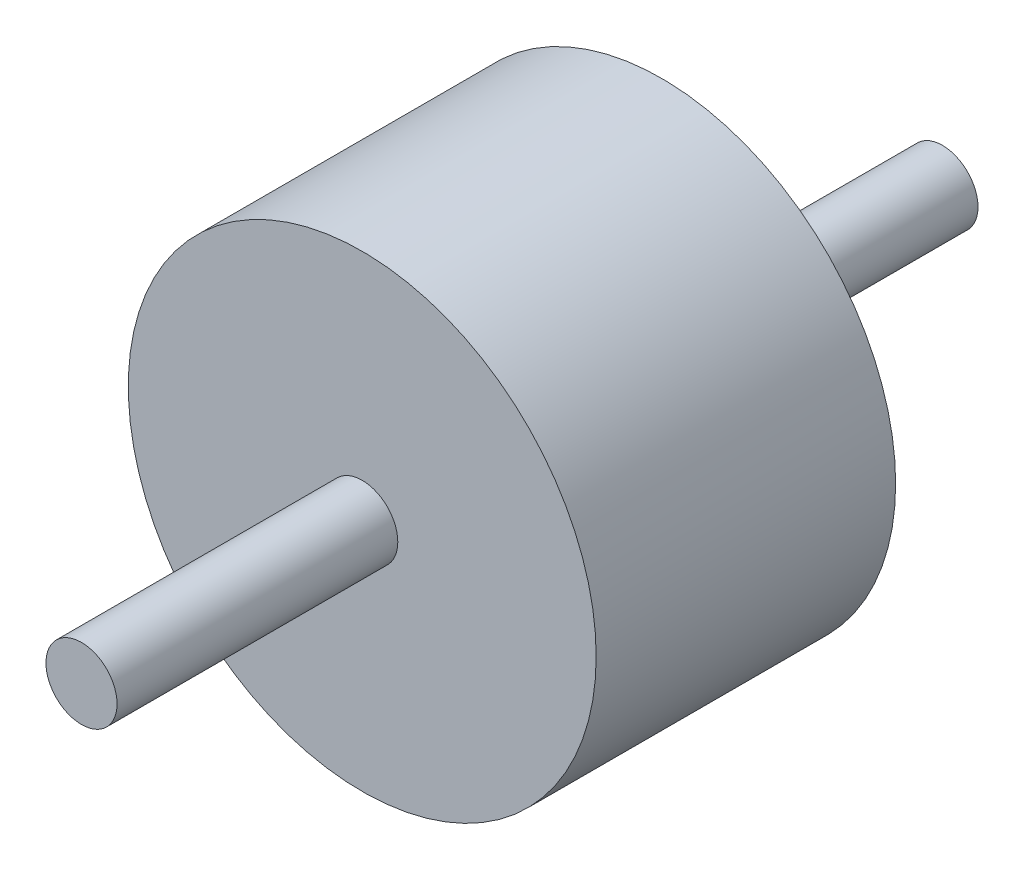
ISO-10303-21;
HEADER;
FILE_DESCRIPTION(('STEP AP214'),'2;1');
FILE_NAME('part.step','',(''),(''),'','','');
FILE_SCHEMA(('AUTOMOTIVE_DESIGN { 1 0 10303 214 1 1 1 1 }'));
ENDSEC;
DATA;
#1=APPLICATION_CONTEXT('core data for automotive mechanical design processes');
#2=APPLICATION_PROTOCOL_DEFINITION('international standard','automotive_design',2000,#1);
#3=PRODUCT_CONTEXT('',#1,'mechanical');
#4=PRODUCT('Part','Part','',(#3));
#5=PRODUCT_RELATED_PRODUCT_CATEGORY('part','',(#4));
#6=PRODUCT_DEFINITION_FORMATION('','',#4);
#7=PRODUCT_DEFINITION_CONTEXT('part definition',#1,'design');
#8=PRODUCT_DEFINITION('design','',#6,#7);
#9=PRODUCT_DEFINITION_SHAPE('','',#8);
#10=(LENGTH_UNIT() NAMED_UNIT(*) SI_UNIT(.MILLI.,.METRE.));
#11=(NAMED_UNIT(*) PLANE_ANGLE_UNIT() SI_UNIT($,.RADIAN.));
#12=(NAMED_UNIT(*) SI_UNIT($,.STERADIAN.) SOLID_ANGLE_UNIT());
#13=UNCERTAINTY_MEASURE_WITH_UNIT(LENGTH_MEASURE(1.E-05),#10,'distance_accuracy_value','');
#14=(GEOMETRIC_REPRESENTATION_CONTEXT(3) GLOBAL_UNCERTAINTY_ASSIGNED_CONTEXT((#13)) GLOBAL_UNIT_ASSIGNED_CONTEXT((#10,
#11,#12)) REPRESENTATION_CONTEXT('',''));
#15=CARTESIAN_POINT('',(0.,0.,0.));
#16=DIRECTION('',(0.,0.,1.));
#17=DIRECTION('',(1.,0.,0.));
#18=AXIS2_PLACEMENT_3D('',#15,#16,#17);
#19=CARTESIAN_POINT('',(0.,0.,0.));
#20=DIRECTION('',(0.,0.,1.));
#21=DIRECTION('',(1.,0.,0.));
#22=AXIS2_PLACEMENT_3D('',#19,#20,#21);
#23=PLANE('',#22);
#24=CARTESIAN_POINT('',(0.,0.,0.));
#25=DIRECTION('',(0.,0.,1.));
#26=DIRECTION('',(1.,0.,0.));
#27=AXIS2_PLACEMENT_3D('',#24,#25,#26);
#28=CIRCLE('',#27,1.25);
#29=CARTESIAN_POINT('',(1.25,0.,0.));
#30=VERTEX_POINT('',#29);
#31=EDGE_CURVE('E44',#30,#30,#28,.T.);
#32=ORIENTED_EDGE('',*,*,#31,.F.);
#33=EDGE_LOOP('',(#32));
#34=FACE_BOUND('',#33,.T.);
#35=CARTESIAN_POINT('',(0.,0.,0.));
#36=DIRECTION('',(0.,0.,1.));
#37=DIRECTION('',(1.,0.,0.));
#38=AXIS2_PLACEMENT_3D('',#35,#36,#37);
#39=CIRCLE('',#38,0.19);
#40=CARTESIAN_POINT('',(0.19,0.,0.));
#41=VERTEX_POINT('',#40);
#42=EDGE_CURVE('E10',#41,#41,#39,.F.);
#43=ORIENTED_EDGE('',*,*,#42,.F.);
#44=EDGE_LOOP('',(#43));
#45=FACE_BOUND('',#44,.T.);
#46=ADVANCED_FACE('F33',(#34,#45),#23,.F.);
#47=CARTESIAN_POINT('',(0.,0.,1.6));
#48=DIRECTION('',(0.,0.,1.));
#49=DIRECTION('',(1.,0.,0.));
#50=AXIS2_PLACEMENT_3D('',#47,#48,#49);
#51=PLANE('',#50);
#52=CARTESIAN_POINT('',(0.,0.,1.6));
#53=DIRECTION('',(0.,0.,1.));
#54=DIRECTION('',(1.,0.,0.));
#55=AXIS2_PLACEMENT_3D('',#52,#53,#54);
#56=CIRCLE('',#55,1.25);
#57=CARTESIAN_POINT('',(1.25,0.,1.6));
#58=VERTEX_POINT('',#57);
#59=EDGE_CURVE('E40',#58,#58,#56,.T.);
#60=ORIENTED_EDGE('',*,*,#59,.T.);
#61=EDGE_LOOP('',(#60));
#62=FACE_BOUND('',#61,.T.);
#63=CARTESIAN_POINT('',(0.,0.,1.6));
#64=DIRECTION('',(0.,0.,1.));
#65=DIRECTION('',(1.,0.,0.));
#66=AXIS2_PLACEMENT_3D('',#63,#64,#65);
#67=CIRCLE('',#66,0.19);
#68=CARTESIAN_POINT('',(0.19,0.,1.6));
#69=VERTEX_POINT('',#68);
#70=EDGE_CURVE('E51',#69,#69,#67,.T.);
#71=ORIENTED_EDGE('',*,*,#70,.F.);
#72=EDGE_LOOP('',(#71));
#73=FACE_BOUND('',#72,.T.);
#74=ADVANCED_FACE('F75',(#62,#73),#51,.T.);
#75=CARTESIAN_POINT('',(0.,0.,1.6));
#76=DIRECTION('',(0.,0.,-1.));
#77=DIRECTION('',(-1.,0.,0.));
#78=AXIS2_PLACEMENT_3D('',#75,#76,#77);
#79=CYLINDRICAL_SURFACE('',#78,1.25);
#80=ORIENTED_EDGE('',*,*,#59,.F.);
#81=EDGE_LOOP('',(#80));
#82=FACE_BOUND('',#81,.T.);
#83=ORIENTED_EDGE('',*,*,#31,.T.);
#84=EDGE_LOOP('',(#83));
#85=FACE_BOUND('',#84,.T.);
#86=ADVANCED_FACE('F35',(#82,#85),#79,.T.);
#87=CARTESIAN_POINT('',(0.,0.,3.1));
#88=DIRECTION('',(0.,0.,-1.));
#89=DIRECTION('',(-1.,0.,0.));
#90=AXIS2_PLACEMENT_3D('',#87,#88,#89);
#91=CYLINDRICAL_SURFACE('',#90,0.19);
#92=CARTESIAN_POINT('',(0.,0.,3.1));
#93=DIRECTION('',(0.,0.,1.));
#94=DIRECTION('',(1.,0.,0.));
#95=AXIS2_PLACEMENT_3D('',#92,#93,#94);
#96=CIRCLE('',#95,0.19);
#97=CARTESIAN_POINT('',(0.19,0.,3.1));
#98=VERTEX_POINT('',#97);
#99=EDGE_CURVE('E49',#98,#98,#96,.T.);
#100=ORIENTED_EDGE('',*,*,#99,.F.);
#101=EDGE_LOOP('',(#100));
#102=FACE_BOUND('',#101,.T.);
#103=ORIENTED_EDGE('',*,*,#70,.T.);
#104=EDGE_LOOP('',(#103));
#105=FACE_BOUND('',#104,.T.);
#106=ADVANCED_FACE('F71',(#102,#105),#91,.T.);
#107=CARTESIAN_POINT('',(0.,0.,3.1));
#108=DIRECTION('',(0.,0.,1.));
#109=DIRECTION('',(1.,0.,0.));
#110=AXIS2_PLACEMENT_3D('',#107,#108,#109);
#111=PLANE('',#110);
#112=ORIENTED_EDGE('',*,*,#99,.T.);
#113=EDGE_LOOP('',(#112));
#114=FACE_BOUND('',#113,.T.);
#115=ADVANCED_FACE('F64',(#114),#111,.T.);
#116=CARTESIAN_POINT('',(0.,0.,-1.5));
#117=DIRECTION('',(0.,0.,1.));
#118=DIRECTION('',(1.,0.,0.));
#119=AXIS2_PLACEMENT_3D('',#116,#117,#118);
#120=CYLINDRICAL_SURFACE('',#119,0.19);
#121=CARTESIAN_POINT('',(0.,0.,-1.5));
#122=DIRECTION('',(0.,0.,-1.));
#123=DIRECTION('',(-1.,0.,0.));
#124=AXIS2_PLACEMENT_3D('',#121,#122,#123);
#125=CIRCLE('',#124,0.19);
#126=CARTESIAN_POINT('',(-0.19,0.,-1.5));
#127=VERTEX_POINT('',#126);
#128=EDGE_CURVE('E54',#127,#127,#125,.T.);
#129=ORIENTED_EDGE('',*,*,#128,.F.);
#130=EDGE_LOOP('',(#129));
#131=FACE_BOUND('',#130,.T.);
#132=ORIENTED_EDGE('',*,*,#42,.T.);
#133=EDGE_LOOP('',(#132));
#134=FACE_BOUND('',#133,.T.);
#135=ADVANCED_FACE('F62',(#131,#134),#120,.T.);
#136=CARTESIAN_POINT('',(0.,0.,-1.5));
#137=DIRECTION('',(0.,0.,-1.));
#138=DIRECTION('',(-1.,0.,0.));
#139=AXIS2_PLACEMENT_3D('',#136,#137,#138);
#140=PLANE('',#139);
#141=ORIENTED_EDGE('',*,*,#128,.T.);
#142=EDGE_LOOP('',(#141));
#143=FACE_BOUND('',#142,.T.);
#144=ADVANCED_FACE('F60',(#143),#140,.T.);
#145=CLOSED_SHELL('',(#46,#74,#86,#106,#115,#135,#144));
#146=MANIFOLD_SOLID_BREP('B2',#145);
#147=ADVANCED_BREP_SHAPE_REPRESENTATION('',(#18,#146),#14);
#148=SHAPE_DEFINITION_REPRESENTATION(#9,#147);
ENDSEC;
END-ISO-10303-21;
